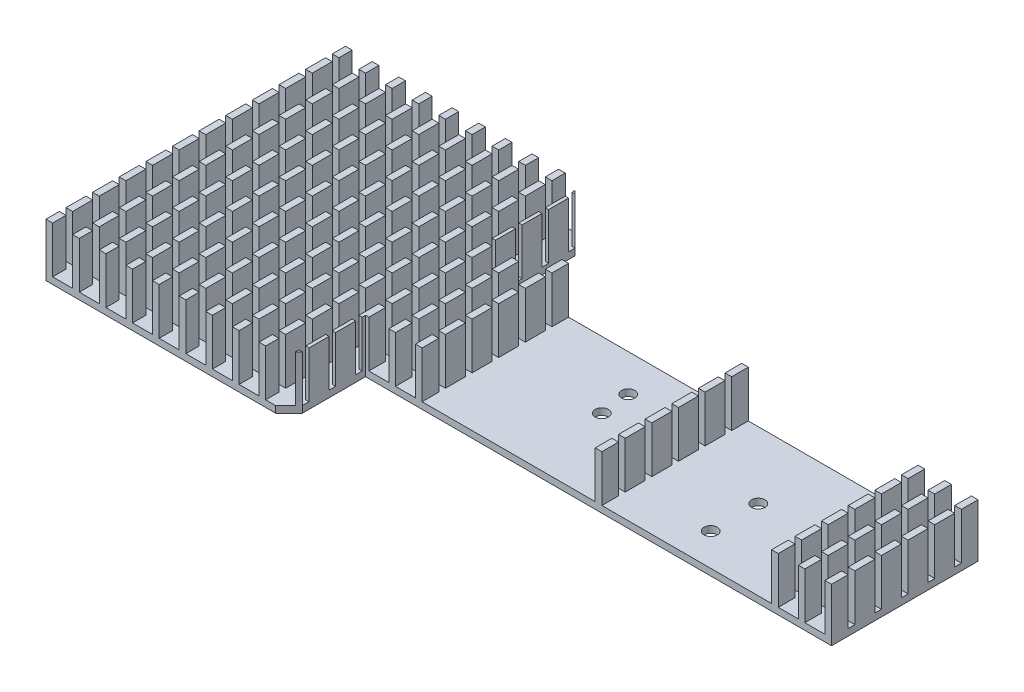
from build123d import *

# Parameters (mm, degrees)
BOSS_EXTRU_1_DEPTH         = 1
ESQUISSE3_W                = 36.5
ESQUISSE3_H                = 45
BOSS_EXTRU_2_DEPTH         = 1
ESQUISSE4_R                = 1
ENL_V_MAT_EXTRU_2_DEPTH    = 84.519458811
CHANFREIN3_SIZE            = 2
ESQUISSE7_W                = 1
ESQUISSE7_H                = 14
BOSS_EXTRU_3_DEPTH         = 45
R_P_TITION_LIN_AIRE1_COUNT = 12
R_P_TITION_LIN_AIRE1_PITCH = 4
ENL_V_MAT_EXTRU_3_DEPTH    = 85.678804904
ESQUISSE10_W               = 1
ESQUISSE10_H               = 14
BOSS_EXTRU_4_DEPTH         = 22
R_P_TITION_LIN_AIRE2_COUNT = 3
R_P_TITION_LIN_AIRE2_PITCH = 4
ESQUISSE11_R               = 1
ENL_V_MAT_EXTRU_4_DEPTH    = 85.678804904
ESQUISSE12_W               = 1
ESQUISSE12_H               = 14
BOSS_EXTRU_5_DEPTH         = 22
ESQUISSE13_W               = 106.5
ESQUISSE13_H               = 7
ENL_V_MAT_EXTRU_5_DEPTH    = 91.012499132
ENL_V_MAT_EXTRU_6_REACH    = 113.931
ESQUISSE14_W               = 1
ESQUISSE14_H               = 7
R_P_TITION_LIN_AIRE3_COUNT = 6
R_P_TITION_LIN_AIRE3_PITCH = 4
R_P_TITION_LIN_AIRE4_COUNT = 6
R_P_TITION_LIN_AIRE4_PITCH = 4


with BuildPart() as part:
    # Esquisse1 → Boss.-Extru.1 (new body)
    with BuildSketch(Plane(origin=(0, 0, 0), x_dir=(1, 0, 0), z_dir=(0, 1, 0))):
        Polygon((-33, 22), (-33, 19.5), (-40, 19.5), (-40, 0), (30, 0), (30, 22), align=None)
    extrude(amount=BOSS_EXTRU_1_DEPTH)

    # Esquisse3 → Boss.-Extru.2 (add)
    with BuildSketch(Plane(origin=(0, 1, 0), x_dir=(1, 0, 0), z_dir=(0, 1, 0))):
        with Locations((-58.25, 11)):
            Rectangle(ESQUISSE3_W, ESQUISSE3_H)
    extrude(amount=-BOSS_EXTRU_2_DEPTH)

    # Esquisse4 → Enl_v. mat.-Extru.2 (cut, through all)
    with BuildSketch(Plane(origin=(0, 1, 0), x_dir=(1, 0, 0), z_dir=(0, 1, 0))):
        with Locations(Location((7, 12, 0), (0, 0, 270))):
            Circle(ESQUISSE4_R)
        with Locations(Location((-16.5, 12, 0), (0, 0, 270))):
            Circle(ESQUISSE4_R)
    extrude(amount=-ENL_V_MAT_EXTRU_2_DEPTH, mode=Mode.SUBTRACT)

    # Chanfrein3
    chanfrein3_edges = [part.edges().sort_by_distance(p)[0] for p in [
        (-40, 0.5, -33.5),
        (-40, 0.5, 11.5),
    ]]
    chamfer(chanfrein3_edges, length=CHANFREIN3_SIZE)

    # Esquisse7 → Boss.-Extru.3 (add)
    with BuildSketch(Plane.XY.offset(11.5)):
        with Locations((-76, 8)):
            Rectangle(ESQUISSE7_W, ESQUISSE7_H)
    boss_extru_3 = extrude(amount=-BOSS_EXTRU_3_DEPTH)

    # R_p_tition lin_aire1: Boss.-Extru.3 ×12
    with Locations(*[(i * R_P_TITION_LIN_AIRE1_PITCH, 0, 0) for i in range(1, R_P_TITION_LIN_AIRE1_COUNT)]):
        add(boss_extru_3)

    # Esquisse9 → Enl_v. mat.-Extru.3 (cut, through all)
    with BuildSketch(Plane.XZ.offset(-1)):
        Polygon((-33, -19.5), (-40, -19.5), (-40, -31.5), (-42, -33.5), (30, -33.5), (30, -22), (-33, -22), align=None)
        Polygon((-40, 0), (-40, 9.5), (-42, 11.5), (30, 11.5), (30, 0), align=None)
    extrude(amount=-ENL_V_MAT_EXTRU_3_DEPTH, mode=Mode.SUBTRACT)

    # Esquisse10 → Boss.-Extru.4 (add)
    with BuildSketch(Plane.XY):
        with Locations((29.5, 8)):
            Rectangle(ESQUISSE10_W, ESQUISSE10_H)
    boss_extru_4 = extrude(amount=-BOSS_EXTRU_4_DEPTH)

    # R_p_tition lin_aire2: Boss.-Extru.4 ×3
    with Locations(*[(-i * R_P_TITION_LIN_AIRE2_PITCH, 0, 0) for i in range(1, R_P_TITION_LIN_AIRE2_COUNT)]):
        add(boss_extru_4)

    # Esquisse11 → Enl_v. mat.-Extru.4 (cut, through all)
    with BuildSketch(Plane(origin=(0, 1, 0), x_dir=(1, 0, 0), z_dir=(0, 1, 0))):
        with Locations(Location((-16.995, 16.45, 0), (0, 0, 270))):
            Circle(ESQUISSE11_R)
        with Locations(Location((6.995, 4.85, 0), (0, 0, 270))):
            Circle(ESQUISSE11_R)
    extrude(amount=-ENL_V_MAT_EXTRU_4_DEPTH, mode=Mode.SUBTRACT)

    # Esquisse12 → Boss.-Extru.5 (add)
    with BuildSketch(Plane(origin=(0, 0, -22), x_dir=(-1, 0, 0), z_dir=(0, 0, -1))):
        with Locations((5, 8)):
            Rectangle(ESQUISSE12_W, ESQUISSE12_H)
    extrude(amount=-BOSS_EXTRU_5_DEPTH)

    # Esquisse13 → Enl_v. mat.-Extru.5 (cut, through all)
    with BuildSketch(Plane.XY.offset(11.5)):
        with Locations((-23.25, 11.5)):
            Rectangle(ESQUISSE13_W, ESQUISSE13_H)
    extrude(amount=-ENL_V_MAT_EXTRU_5_DEPTH, mode=Mode.SUBTRACT)

    # Enl_v. mat.-Extru.6: up to this face of the body (flat: up to its plane)
    enl_v_mat_extru_6_end = Plane(part.part.faces().sort_by_distance((30, 4, -11))[0])
    # Esquisse14 → Enl_v. mat.-Extru.6 (cut, up to the picked face)
    with BuildSketch(Plane.ZY.offset(76.5), mode=Mode.PRIVATE) as enl_v_mat_extru_6_sk1:
        with Locations((-11, 4.5)):
            Rectangle(ESQUISSE14_W, ESQUISSE14_H)
    enl_v_mat_extru_6_tool1 = split(extrude(enl_v_mat_extru_6_sk1.sketch, amount=-ENL_V_MAT_EXTRU_6_REACH, mode=Mode.PRIVATE), bisect_by=enl_v_mat_extru_6_end, keep=Keep.BOTH, mode=Mode.PRIVATE)
    enl_v_mat_extru_6 = enl_v_mat_extru_6_tool1.solids().sort_by(Axis((-76.5, 4.5, -11), (1, 0, 0)))[0]
    add(enl_v_mat_extru_6, mode=Mode.SUBTRACT)

    # R_p_tition lin_aire3: Enl_v. mat.-Extru.6 ×6
    with Locations(*[(0, 0, -i * R_P_TITION_LIN_AIRE3_PITCH) for i in range(1, R_P_TITION_LIN_AIRE3_COUNT)]):
        add(enl_v_mat_extru_6, mode=Mode.SUBTRACT)

    # R_p_tition lin_aire4: Enl_v. mat.-Extru.6 ×6
    with Locations(*[(0, 0, i * R_P_TITION_LIN_AIRE4_PITCH) for i in range(1, R_P_TITION_LIN_AIRE4_COUNT)]):
        add(enl_v_mat_extru_6, mode=Mode.SUBTRACT)


solid = part.part
